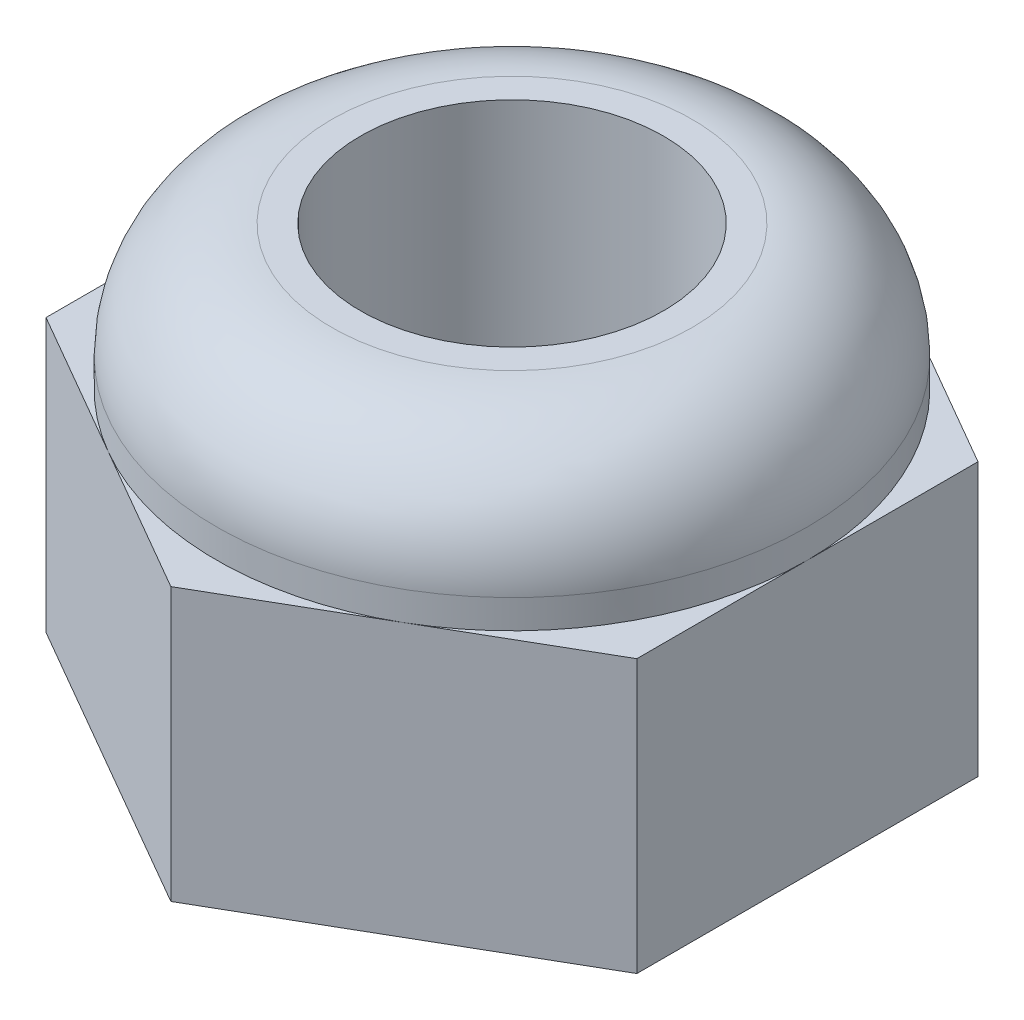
ISO-10303-21;
HEADER;
FILE_DESCRIPTION(('STEP AP214'),'2;1');
FILE_NAME('part.step','',(''),(''),'','','');
FILE_SCHEMA(('AUTOMOTIVE_DESIGN { 1 0 10303 214 1 1 1 1 }'));
ENDSEC;
DATA;
#1=APPLICATION_CONTEXT('core data for automotive mechanical design processes');
#2=APPLICATION_PROTOCOL_DEFINITION('international standard','automotive_design',2000,#1);
#3=PRODUCT_CONTEXT('',#1,'mechanical');
#4=PRODUCT('Part','Part','',(#3));
#5=PRODUCT_RELATED_PRODUCT_CATEGORY('part','',(#4));
#6=PRODUCT_DEFINITION_FORMATION('','',#4);
#7=PRODUCT_DEFINITION_CONTEXT('part definition',#1,'design');
#8=PRODUCT_DEFINITION('design','',#6,#7);
#9=PRODUCT_DEFINITION_SHAPE('','',#8);
#10=(LENGTH_UNIT() NAMED_UNIT(*) SI_UNIT(.MILLI.,.METRE.));
#11=(NAMED_UNIT(*) PLANE_ANGLE_UNIT() SI_UNIT($,.RADIAN.));
#12=(NAMED_UNIT(*) SI_UNIT($,.STERADIAN.) SOLID_ANGLE_UNIT());
#13=UNCERTAINTY_MEASURE_WITH_UNIT(LENGTH_MEASURE(1.E-05),#10,'distance_accuracy_value','');
#14=(GEOMETRIC_REPRESENTATION_CONTEXT(3) GLOBAL_UNCERTAINTY_ASSIGNED_CONTEXT((#13)) GLOBAL_UNIT_ASSIGNED_CONTEXT((#10,
#11,#12)) REPRESENTATION_CONTEXT('',''));
#15=CARTESIAN_POINT('',(0.,0.,0.));
#16=DIRECTION('',(0.,0.,1.));
#17=DIRECTION('',(1.,0.,0.));
#18=AXIS2_PLACEMENT_3D('',#15,#16,#17);
#19=CARTESIAN_POINT('',(1.95,1.8,1.12583302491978));
#20=DIRECTION('',(0.,1.,0.));
#21=DIRECTION('',(0.,0.,1.));
#22=AXIS2_PLACEMENT_3D('',#19,#20,#21);
#23=PLANE('',#22);
#24=DIRECTION('',(0.,0.,-1.));
#25=VECTOR('',#24,1.);
#26=CARTESIAN_POINT('',(1.95,1.8,1.12583302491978));
#27=LINE('',#26,#25);
#28=CARTESIAN_POINT('',(1.95,1.8,1.12583302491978));
#29=VERTEX_POINT('',#28);
#30=CARTESIAN_POINT('',(1.95,1.8,0.));
#31=VERTEX_POINT('',#30);
#32=EDGE_CURVE('E222',#29,#31,#27,.T.);
#33=ORIENTED_EDGE('',*,*,#32,.T.);
#34=CARTESIAN_POINT('',(0.,1.8,0.));
#35=DIRECTION('',(0.,-1.,0.));
#36=DIRECTION('',(1.,0.,0.));
#37=AXIS2_PLACEMENT_3D('',#34,#35,#36);
#38=CIRCLE('',#37,1.95000000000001);
#39=CARTESIAN_POINT('',(0.975000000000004,1.8,1.68874953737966));
#40=VERTEX_POINT('',#39);
#41=EDGE_CURVE('E45',#31,#40,#38,.T.);
#42=ORIENTED_EDGE('',*,*,#41,.T.);
#43=DIRECTION('',(0.866025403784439,0.,-0.5));
#44=VECTOR('',#43,1.);
#45=CARTESIAN_POINT('',(0.,1.8,2.25166604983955));
#46=LINE('',#45,#44);
#47=EDGE_CURVE('E95',#40,#29,#46,.T.);
#48=ORIENTED_EDGE('',*,*,#47,.T.);
#49=EDGE_LOOP('',(#33,#42,#48));
#50=FACE_BOUND('',#49,.T.);
#51=ADVANCED_FACE('F34',(#50),#23,.T.);
#52=CARTESIAN_POINT('',(0.,1.8,2.25166604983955));
#53=VERTEX_POINT('',#52);
#54=EDGE_CURVE('E200',#53,#40,#46,.T.);
#55=ORIENTED_EDGE('',*,*,#54,.T.);
#56=CARTESIAN_POINT('',(-0.975000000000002,1.8,1.68874953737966));
#57=VERTEX_POINT('',#56);
#58=EDGE_CURVE('E11',#40,#57,#38,.T.);
#59=ORIENTED_EDGE('',*,*,#58,.T.);
#60=DIRECTION('',(0.866025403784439,0.,0.5));
#61=VECTOR('',#60,1.);
#62=CARTESIAN_POINT('',(-1.95000000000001,1.8,1.12583302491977));
#63=LINE('',#62,#61);
#64=EDGE_CURVE('E59',#57,#53,#63,.T.);
#65=ORIENTED_EDGE('',*,*,#64,.T.);
#66=EDGE_LOOP('',(#55,#59,#65));
#67=FACE_BOUND('',#66,.T.);
#68=ADVANCED_FACE('F219',(#67),#23,.T.);
#69=CARTESIAN_POINT('',(-1.95000000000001,1.8,1.12583302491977));
#70=VERTEX_POINT('',#69);
#71=EDGE_CURVE('E140',#70,#57,#63,.T.);
#72=ORIENTED_EDGE('',*,*,#71,.T.);
#73=CARTESIAN_POINT('',(-1.95000000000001,1.8,0.));
#74=VERTEX_POINT('',#73);
#75=EDGE_CURVE('E43',#57,#74,#38,.T.);
#76=ORIENTED_EDGE('',*,*,#75,.T.);
#77=DIRECTION('',(0.,0.,1.));
#78=VECTOR('',#77,1.);
#79=CARTESIAN_POINT('',(-1.95000000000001,1.8,-1.12583302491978));
#80=LINE('',#79,#78);
#81=EDGE_CURVE('E138',#74,#70,#80,.T.);
#82=ORIENTED_EDGE('',*,*,#81,.T.);
#83=EDGE_LOOP('',(#72,#76,#82));
#84=FACE_BOUND('',#83,.T.);
#85=ADVANCED_FACE('F207',(#84),#23,.T.);
#86=CARTESIAN_POINT('',(-1.95000000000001,1.8,-1.12583302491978));
#87=VERTEX_POINT('',#86);
#88=EDGE_CURVE('E114',#87,#74,#80,.T.);
#89=ORIENTED_EDGE('',*,*,#88,.T.);
#90=CARTESIAN_POINT('',(-0.975000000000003,1.8,-1.68874953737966));
#91=VERTEX_POINT('',#90);
#92=EDGE_CURVE('E117',#74,#91,#38,.T.);
#93=ORIENTED_EDGE('',*,*,#92,.T.);
#94=DIRECTION('',(-0.866025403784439,0.,0.5));
#95=VECTOR('',#94,1.);
#96=CARTESIAN_POINT('',(0.,1.8,-2.25166604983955));
#97=LINE('',#96,#95);
#98=EDGE_CURVE('E109',#91,#87,#97,.T.);
#99=ORIENTED_EDGE('',*,*,#98,.T.);
#100=EDGE_LOOP('',(#89,#93,#99));
#101=FACE_BOUND('',#100,.T.);
#102=ADVANCED_FACE('F111',(#101),#23,.T.);
#103=CARTESIAN_POINT('',(0.,1.8,-2.25166604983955));
#104=VERTEX_POINT('',#103);
#105=EDGE_CURVE('E121',#104,#91,#97,.T.);
#106=ORIENTED_EDGE('',*,*,#105,.T.);
#107=CARTESIAN_POINT('',(0.975000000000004,1.8,-1.68874953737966));
#108=VERTEX_POINT('',#107);
#109=EDGE_CURVE('E170',#91,#108,#38,.T.);
#110=ORIENTED_EDGE('',*,*,#109,.T.);
#111=DIRECTION('',(-0.866025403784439,0.,-0.5));
#112=VECTOR('',#111,1.);
#113=CARTESIAN_POINT('',(1.95,1.8,-1.12583302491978));
#114=LINE('',#113,#112);
#115=EDGE_CURVE('E214',#108,#104,#114,.T.);
#116=ORIENTED_EDGE('',*,*,#115,.T.);
#117=EDGE_LOOP('',(#106,#110,#116));
#118=FACE_BOUND('',#117,.T.);
#119=ADVANCED_FACE('F212',(#118),#23,.T.);
#120=CARTESIAN_POINT('',(1.95,1.8,-1.12583302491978));
#121=VERTEX_POINT('',#120);
#122=EDGE_CURVE('E122',#121,#108,#114,.T.);
#123=ORIENTED_EDGE('',*,*,#122,.T.);
#124=EDGE_CURVE('E167',#108,#31,#38,.T.);
#125=ORIENTED_EDGE('',*,*,#124,.T.);
#126=EDGE_CURVE('E220',#31,#121,#27,.T.);
#127=ORIENTED_EDGE('',*,*,#126,.T.);
#128=EDGE_LOOP('',(#123,#125,#127));
#129=FACE_BOUND('',#128,.T.);
#130=ADVANCED_FACE('F225',(#129),#23,.T.);
#131=CARTESIAN_POINT('',(0.,1.8,2.25166604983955));
#132=DIRECTION('',(-0.5,0.,-0.866025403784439));
#133=DIRECTION('',(-0.866025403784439,0.,0.5));
#134=AXIS2_PLACEMENT_3D('',#131,#132,#133);
#135=PLANE('',#134);
#136=DIRECTION('',(0.866025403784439,0.,-0.5));
#137=VECTOR('',#136,1.);
#138=CARTESIAN_POINT('',(0.,0.,2.25166604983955));
#139=LINE('',#138,#137);
#140=CARTESIAN_POINT('',(0.,0.,2.25166604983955));
#141=VERTEX_POINT('',#140);
#142=CARTESIAN_POINT('',(1.95,0.,1.12583302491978));
#143=VERTEX_POINT('',#142);
#144=EDGE_CURVE('E146',#141,#143,#139,.T.);
#145=ORIENTED_EDGE('',*,*,#144,.T.);
#146=DIRECTION('',(0.,-1.,0.));
#147=VECTOR('',#146,1.);
#148=CARTESIAN_POINT('',(1.95,1.8,1.12583302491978));
#149=LINE('',#148,#147);
#150=EDGE_CURVE('E38',#29,#143,#149,.T.);
#151=ORIENTED_EDGE('',*,*,#150,.F.);
#152=ORIENTED_EDGE('',*,*,#47,.F.);
#153=ORIENTED_EDGE('',*,*,#54,.F.);
#154=DIRECTION('',(0.,-1.,0.));
#155=VECTOR('',#154,1.);
#156=CARTESIAN_POINT('',(0.,1.8,2.25166604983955));
#157=LINE('',#156,#155);
#158=EDGE_CURVE('E145',#53,#141,#157,.T.);
#159=ORIENTED_EDGE('',*,*,#158,.T.);
#160=EDGE_LOOP('',(#145,#151,#152,#153,#159));
#161=FACE_BOUND('',#160,.T.);
#162=ADVANCED_FACE('F36',(#161),#135,.F.);
#163=CARTESIAN_POINT('',(1.95,1.8,1.12583302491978));
#164=DIRECTION('',(-1.,0.,0.));
#165=DIRECTION('',(0.,0.,1.));
#166=AXIS2_PLACEMENT_3D('',#163,#164,#165);
#167=PLANE('',#166);
#168=DIRECTION('',(0.,0.,-1.));
#169=VECTOR('',#168,1.);
#170=CARTESIAN_POINT('',(1.95,0.,1.12583302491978));
#171=LINE('',#170,#169);
#172=CARTESIAN_POINT('',(1.95,0.,-1.12583302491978));
#173=VERTEX_POINT('',#172);
#174=EDGE_CURVE('E149',#143,#173,#171,.T.);
#175=ORIENTED_EDGE('',*,*,#174,.T.);
#176=DIRECTION('',(0.,-1.,0.));
#177=VECTOR('',#176,1.);
#178=CARTESIAN_POINT('',(1.95,1.8,-1.12583302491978));
#179=LINE('',#178,#177);
#180=EDGE_CURVE('E160',#121,#173,#179,.T.);
#181=ORIENTED_EDGE('',*,*,#180,.F.);
#182=ORIENTED_EDGE('',*,*,#126,.F.);
#183=ORIENTED_EDGE('',*,*,#32,.F.);
#184=ORIENTED_EDGE('',*,*,#150,.T.);
#185=EDGE_LOOP('',(#175,#181,#182,#183,#184));
#186=FACE_BOUND('',#185,.T.);
#187=ADVANCED_FACE('F226',(#186),#167,.F.);
#188=CARTESIAN_POINT('',(1.95,1.8,-1.12583302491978));
#189=DIRECTION('',(-0.5,0.,0.866025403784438));
#190=DIRECTION('',(0.866025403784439,0.,0.5));
#191=AXIS2_PLACEMENT_3D('',#188,#189,#190);
#192=PLANE('',#191);
#193=DIRECTION('',(-0.866025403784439,0.,-0.5));
#194=VECTOR('',#193,1.);
#195=CARTESIAN_POINT('',(1.95,0.,-1.12583302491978));
#196=LINE('',#195,#194);
#197=CARTESIAN_POINT('',(0.,0.,-2.25166604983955));
#198=VERTEX_POINT('',#197);
#199=EDGE_CURVE('E152',#173,#198,#196,.T.);
#200=ORIENTED_EDGE('',*,*,#199,.T.);
#201=DIRECTION('',(0.,-1.,0.));
#202=VECTOR('',#201,1.);
#203=CARTESIAN_POINT('',(0.,1.8,-2.25166604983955));
#204=LINE('',#203,#202);
#205=EDGE_CURVE('E132',#104,#198,#204,.T.);
#206=ORIENTED_EDGE('',*,*,#205,.F.);
#207=ORIENTED_EDGE('',*,*,#115,.F.);
#208=ORIENTED_EDGE('',*,*,#122,.F.);
#209=ORIENTED_EDGE('',*,*,#180,.T.);
#210=EDGE_LOOP('',(#200,#206,#207,#208,#209));
#211=FACE_BOUND('',#210,.T.);
#212=ADVANCED_FACE('F209',(#211),#192,.F.);
#213=CARTESIAN_POINT('',(0.,1.8,-2.25166604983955));
#214=DIRECTION('',(0.5,0.,0.866025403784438));
#215=DIRECTION('',(0.866025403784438,0.,-0.5));
#216=AXIS2_PLACEMENT_3D('',#213,#214,#215);
#217=PLANE('',#216);
#218=DIRECTION('',(-0.866025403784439,0.,0.5));
#219=VECTOR('',#218,1.);
#220=CARTESIAN_POINT('',(0.,0.,-2.25166604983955));
#221=LINE('',#220,#219);
#222=CARTESIAN_POINT('',(-1.95000000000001,0.,-1.12583302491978));
#223=VERTEX_POINT('',#222);
#224=EDGE_CURVE('E129',#198,#223,#221,.T.);
#225=ORIENTED_EDGE('',*,*,#224,.T.);
#226=DIRECTION('',(0.,-1.,0.));
#227=VECTOR('',#226,1.);
#228=CARTESIAN_POINT('',(-1.95000000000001,1.8,-1.12583302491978));
#229=LINE('',#228,#227);
#230=EDGE_CURVE('E125',#87,#223,#229,.T.);
#231=ORIENTED_EDGE('',*,*,#230,.F.);
#232=ORIENTED_EDGE('',*,*,#98,.F.);
#233=ORIENTED_EDGE('',*,*,#105,.F.);
#234=ORIENTED_EDGE('',*,*,#205,.T.);
#235=EDGE_LOOP('',(#225,#231,#232,#233,#234));
#236=FACE_BOUND('',#235,.T.);
#237=ADVANCED_FACE('F126',(#236),#217,.F.);
#238=CARTESIAN_POINT('',(-1.95000000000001,1.8,-1.12583302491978));
#239=DIRECTION('',(1.,0.,0.));
#240=DIRECTION('',(0.,0.,-1.));
#241=AXIS2_PLACEMENT_3D('',#238,#239,#240);
#242=PLANE('',#241);
#243=DIRECTION('',(0.,0.,1.));
#244=VECTOR('',#243,1.);
#245=CARTESIAN_POINT('',(-1.95000000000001,0.,-1.12583302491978));
#246=LINE('',#245,#244);
#247=CARTESIAN_POINT('',(-1.95000000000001,0.,1.12583302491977));
#248=VERTEX_POINT('',#247);
#249=EDGE_CURVE('E155',#223,#248,#246,.T.);
#250=ORIENTED_EDGE('',*,*,#249,.T.);
#251=DIRECTION('',(0.,-1.,0.));
#252=VECTOR('',#251,1.);
#253=CARTESIAN_POINT('',(-1.95000000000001,1.8,1.12583302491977));
#254=LINE('',#253,#252);
#255=EDGE_CURVE('E133',#70,#248,#254,.T.);
#256=ORIENTED_EDGE('',*,*,#255,.F.);
#257=ORIENTED_EDGE('',*,*,#81,.F.);
#258=ORIENTED_EDGE('',*,*,#88,.F.);
#259=ORIENTED_EDGE('',*,*,#230,.T.);
#260=EDGE_LOOP('',(#250,#256,#257,#258,#259));
#261=FACE_BOUND('',#260,.T.);
#262=ADVANCED_FACE('F136',(#261),#242,.F.);
#263=CARTESIAN_POINT('',(-1.95000000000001,1.8,1.12583302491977));
#264=DIRECTION('',(0.5,0.,-0.866025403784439));
#265=DIRECTION('',(-0.866025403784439,0.,-0.5));
#266=AXIS2_PLACEMENT_3D('',#263,#264,#265);
#267=PLANE('',#266);
#268=DIRECTION('',(0.866025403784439,0.,0.5));
#269=VECTOR('',#268,1.);
#270=CARTESIAN_POINT('',(-1.95000000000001,0.,1.12583302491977));
#271=LINE('',#270,#269);
#272=EDGE_CURVE('E87',#248,#141,#271,.T.);
#273=ORIENTED_EDGE('',*,*,#272,.T.);
#274=ORIENTED_EDGE('',*,*,#158,.F.);
#275=ORIENTED_EDGE('',*,*,#64,.F.);
#276=ORIENTED_EDGE('',*,*,#71,.F.);
#277=ORIENTED_EDGE('',*,*,#255,.T.);
#278=EDGE_LOOP('',(#273,#274,#275,#276,#277));
#279=FACE_BOUND('',#278,.T.);
#280=ADVANCED_FACE('F195',(#279),#267,.F.);
#281=CARTESIAN_POINT('',(1.95,0.,1.12583302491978));
#282=DIRECTION('',(0.,1.,0.));
#283=DIRECTION('',(0.,0.,1.));
#284=AXIS2_PLACEMENT_3D('',#281,#282,#283);
#285=PLANE('',#284);
#286=CARTESIAN_POINT('',(0.,0.,0.));
#287=DIRECTION('',(0.,-1.,0.));
#288=DIRECTION('',(0.,0.,-1.));
#289=AXIS2_PLACEMENT_3D('',#286,#287,#288);
#290=CIRCLE('',#289,1.);
#291=CARTESIAN_POINT('',(0.,0.,-1.));
#292=VERTEX_POINT('',#291);
#293=EDGE_CURVE('E182',#292,#292,#290,.T.);
#294=ORIENTED_EDGE('',*,*,#293,.F.);
#295=EDGE_LOOP('',(#294));
#296=FACE_BOUND('',#295,.T.);
#297=ORIENTED_EDGE('',*,*,#144,.F.);
#298=ORIENTED_EDGE('',*,*,#272,.F.);
#299=ORIENTED_EDGE('',*,*,#249,.F.);
#300=ORIENTED_EDGE('',*,*,#224,.F.);
#301=ORIENTED_EDGE('',*,*,#199,.F.);
#302=ORIENTED_EDGE('',*,*,#174,.F.);
#303=EDGE_LOOP('',(#297,#298,#299,#300,#301,#302));
#304=FACE_BOUND('',#303,.T.);
#305=ADVANCED_FACE('F191',(#296,#304),#285,.F.);
#306=CARTESIAN_POINT('',(0.,2.75,0.));
#307=DIRECTION('',(0.,-1.,0.));
#308=DIRECTION('',(1.,0.,0.));
#309=AXIS2_PLACEMENT_3D('',#306,#307,#308);
#310=PLANE('',#309);
#311=CARTESIAN_POINT('',(0.,2.75,0.));
#312=DIRECTION('',(0.,-1.,0.));
#313=DIRECTION('',(0.,0.,-1.));
#314=AXIS2_PLACEMENT_3D('',#311,#312,#313);
#315=CIRCLE('',#314,1.);
#316=CARTESIAN_POINT('',(0.,2.75,-1.));
#317=VERTEX_POINT('',#316);
#318=EDGE_CURVE('E178',#317,#317,#315,.T.);
#319=ORIENTED_EDGE('',*,*,#318,.T.);
#320=EDGE_LOOP('',(#319));
#321=FACE_BOUND('',#320,.T.);
#322=CARTESIAN_POINT('',(0.,2.75,0.));
#323=DIRECTION('',(0.,-1.,0.));
#324=DIRECTION('',(1.,0.,0.));
#325=AXIS2_PLACEMENT_3D('',#322,#323,#324);
#326=CIRCLE('',#325,1.19000000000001);
#327=CARTESIAN_POINT('',(1.19000000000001,2.75,0.));
#328=VERTEX_POINT('',#327);
#329=EDGE_CURVE('E150',#328,#328,#326,.T.);
#330=ORIENTED_EDGE('',*,*,#329,.F.);
#331=EDGE_LOOP('',(#330));
#332=FACE_BOUND('',#331,.T.);
#333=ADVANCED_FACE('F194',(#321,#332),#310,.F.);
#334=CARTESIAN_POINT('',(0.,1.99,0.));
#335=DIRECTION('',(0.,-1.,0.));
#336=DIRECTION('',(1.,0.,0.));
#337=AXIS2_PLACEMENT_3D('',#334,#335,#336);
#338=TOROIDAL_SURFACE('',#337,1.19000000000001,0.759999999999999);
#339=CARTESIAN_POINT('',(0.,1.99,0.));
#340=DIRECTION('',(0.,-1.,0.));
#341=DIRECTION('',(1.,0.,0.));
#342=AXIS2_PLACEMENT_3D('',#339,#340,#341);
#343=CIRCLE('',#342,1.95000000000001);
#344=CARTESIAN_POINT('',(1.95000000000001,1.99,0.));
#345=VERTEX_POINT('',#344);
#346=EDGE_CURVE('E177',#345,#345,#343,.T.);
#347=ORIENTED_EDGE('',*,*,#346,.F.);
#348=EDGE_LOOP('',(#347));
#349=FACE_BOUND('',#348,.T.);
#350=ORIENTED_EDGE('',*,*,#329,.T.);
#351=EDGE_LOOP('',(#350));
#352=FACE_BOUND('',#351,.T.);
#353=ADVANCED_FACE('F269',(#349,#352),#338,.T.);
#354=CARTESIAN_POINT('',(0.,1.8,0.));
#355=DIRECTION('',(0.,-1.,0.));
#356=DIRECTION('',(1.,0.,0.));
#357=AXIS2_PLACEMENT_3D('',#354,#355,#356);
#358=CYLINDRICAL_SURFACE('',#357,1.95000000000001);
#359=ORIENTED_EDGE('',*,*,#41,.F.);
#360=ORIENTED_EDGE('',*,*,#124,.F.);
#361=ORIENTED_EDGE('',*,*,#109,.F.);
#362=ORIENTED_EDGE('',*,*,#92,.F.);
#363=ORIENTED_EDGE('',*,*,#75,.F.);
#364=ORIENTED_EDGE('',*,*,#58,.F.);
#365=EDGE_LOOP('',(#359,#360,#361,#362,#363,#364));
#366=FACE_BOUND('',#365,.T.);
#367=ORIENTED_EDGE('',*,*,#346,.T.);
#368=EDGE_LOOP('',(#367));
#369=FACE_BOUND('',#368,.T.);
#370=ADVANCED_FACE('F217',(#366,#369),#358,.T.);
#371=CARTESIAN_POINT('',(0.,2.75,0.));
#372=DIRECTION('',(0.,-1.,0.));
#373=DIRECTION('',(0.,0.,-1.));
#374=AXIS2_PLACEMENT_3D('',#371,#372,#373);
#375=CYLINDRICAL_SURFACE('',#374,1.);
#376=ORIENTED_EDGE('',*,*,#318,.F.);
#377=EDGE_LOOP('',(#376));
#378=FACE_BOUND('',#377,.T.);
#379=ORIENTED_EDGE('',*,*,#293,.T.);
#380=EDGE_LOOP('',(#379));
#381=FACE_BOUND('',#380,.T.);
#382=ADVANCED_FACE('F189',(#378,#381),#375,.F.);
#383=CLOSED_SHELL('',(#51,#68,#85,#102,#119,#130,#162,#187,#212,#237,#262,#280,#305,#333,#353,
#370,#382));
#384=MANIFOLD_SOLID_BREP('B2',#383);
#385=ADVANCED_BREP_SHAPE_REPRESENTATION('',(#18,#384),#14);
#386=SHAPE_DEFINITION_REPRESENTATION(#9,#385);
ENDSEC;
END-ISO-10303-21;
